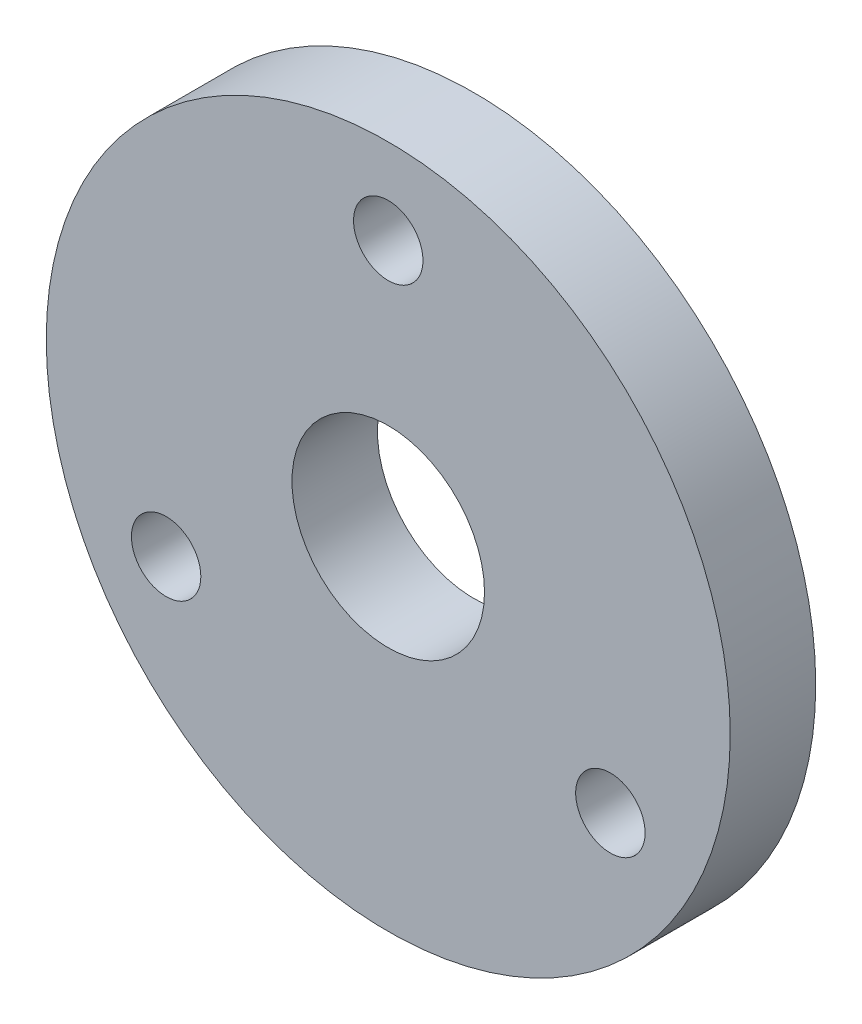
ISO-10303-21;
HEADER;
FILE_DESCRIPTION(('STEP AP214'),'2;1');
FILE_NAME('part.step','',(''),(''),'','','');
FILE_SCHEMA(('AUTOMOTIVE_DESIGN { 1 0 10303 214 1 1 1 1 }'));
ENDSEC;
DATA;
#1=APPLICATION_CONTEXT('core data for automotive mechanical design processes');
#2=APPLICATION_PROTOCOL_DEFINITION('international standard','automotive_design',2000,#1);
#3=PRODUCT_CONTEXT('',#1,'mechanical');
#4=PRODUCT('Part','Part','',(#3));
#5=PRODUCT_RELATED_PRODUCT_CATEGORY('part','',(#4));
#6=PRODUCT_DEFINITION_FORMATION('','',#4);
#7=PRODUCT_DEFINITION_CONTEXT('part definition',#1,'design');
#8=PRODUCT_DEFINITION('design','',#6,#7);
#9=PRODUCT_DEFINITION_SHAPE('','',#8);
#10=(LENGTH_UNIT() NAMED_UNIT(*) SI_UNIT(.MILLI.,.METRE.));
#11=(NAMED_UNIT(*) PLANE_ANGLE_UNIT() SI_UNIT($,.RADIAN.));
#12=(NAMED_UNIT(*) SI_UNIT($,.STERADIAN.) SOLID_ANGLE_UNIT());
#13=UNCERTAINTY_MEASURE_WITH_UNIT(LENGTH_MEASURE(1.E-05),#10,'distance_accuracy_value','');
#14=(GEOMETRIC_REPRESENTATION_CONTEXT(3) GLOBAL_UNCERTAINTY_ASSIGNED_CONTEXT((#13)) GLOBAL_UNIT_ASSIGNED_CONTEXT((#10,
#11,#12)) REPRESENTATION_CONTEXT('',''));
#15=CARTESIAN_POINT('',(0.,0.,0.));
#16=DIRECTION('',(0.,0.,1.));
#17=DIRECTION('',(1.,0.,0.));
#18=AXIS2_PLACEMENT_3D('',#15,#16,#17);
#19=CARTESIAN_POINT('',(0.,0.,3.175));
#20=DIRECTION('',(0.,0.,1.));
#21=DIRECTION('',(1.,0.,0.));
#22=AXIS2_PLACEMENT_3D('',#19,#20,#21);
#23=PLANE('',#22);
#24=CARTESIAN_POINT('',(-16.4977839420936,-9.52499999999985,3.175));
#25=DIRECTION('',(0.,0.,1.));
#26=DIRECTION('',(1.,0.,0.));
#27=AXIS2_PLACEMENT_3D('',#24,#25,#26);
#28=CIRCLE('',#27,2.57810000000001);
#29=CARTESIAN_POINT('',(-13.9196839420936,-9.52499999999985,3.175));
#30=VERTEX_POINT('',#29);
#31=EDGE_CURVE('E62',#30,#30,#28,.T.);
#32=ORIENTED_EDGE('',*,*,#31,.F.);
#33=EDGE_LOOP('',(#32));
#34=FACE_BOUND('',#33,.T.);
#35=CARTESIAN_POINT('',(16.4977839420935,-9.52500000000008,3.175));
#36=DIRECTION('',(0.,0.,1.));
#37=DIRECTION('',(1.,0.,0.));
#38=AXIS2_PLACEMENT_3D('',#35,#36,#37);
#39=CIRCLE('',#38,2.57810000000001);
#40=CARTESIAN_POINT('',(19.0758839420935,-9.52500000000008,3.175));
#41=VERTEX_POINT('',#40);
#42=EDGE_CURVE('E52',#41,#41,#39,.T.);
#43=ORIENTED_EDGE('',*,*,#42,.F.);
#44=EDGE_LOOP('',(#43));
#45=FACE_BOUND('',#44,.T.);
#46=CARTESIAN_POINT('',(0.,19.05,3.175));
#47=DIRECTION('',(0.,0.,1.));
#48=DIRECTION('',(1.,0.,0.));
#49=AXIS2_PLACEMENT_3D('',#46,#47,#48);
#50=CIRCLE('',#49,2.57810000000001);
#51=CARTESIAN_POINT('',(2.57810000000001,19.05,3.175));
#52=VERTEX_POINT('',#51);
#53=EDGE_CURVE('E49',#52,#52,#50,.T.);
#54=ORIENTED_EDGE('',*,*,#53,.F.);
#55=EDGE_LOOP('',(#54));
#56=FACE_BOUND('',#55,.T.);
#57=CARTESIAN_POINT('',(0.,0.,3.175));
#58=DIRECTION('',(0.,0.,1.));
#59=DIRECTION('',(1.,0.,0.));
#60=AXIS2_PLACEMENT_3D('',#57,#58,#59);
#61=CIRCLE('',#60,25.4);
#62=CARTESIAN_POINT('',(25.4,0.,3.175));
#63=VERTEX_POINT('',#62);
#64=EDGE_CURVE('E10',#63,#63,#61,.T.);
#65=ORIENTED_EDGE('',*,*,#64,.T.);
#66=EDGE_LOOP('',(#65));
#67=FACE_BOUND('',#66,.T.);
#68=CARTESIAN_POINT('',(0.,0.,3.175));
#69=DIRECTION('',(0.,0.,1.));
#70=DIRECTION('',(1.,0.,0.));
#71=AXIS2_PLACEMENT_3D('',#68,#69,#70);
#72=CIRCLE('',#71,7.1501);
#73=CARTESIAN_POINT('',(7.1501,0.,3.175));
#74=VERTEX_POINT('',#73);
#75=EDGE_CURVE('E42',#74,#74,#72,.T.);
#76=ORIENTED_EDGE('',*,*,#75,.F.);
#77=EDGE_LOOP('',(#76));
#78=FACE_BOUND('',#77,.T.);
#79=ADVANCED_FACE('F29',(#34,#45,#56,#67,#78),#23,.T.);
#80=CARTESIAN_POINT('',(0.,0.,-3.175));
#81=DIRECTION('',(0.,0.,1.));
#82=DIRECTION('',(1.,0.,0.));
#83=AXIS2_PLACEMENT_3D('',#80,#81,#82);
#84=PLANE('',#83);
#85=CARTESIAN_POINT('',(-16.4977839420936,-9.52499999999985,-3.175));
#86=DIRECTION('',(0.,0.,1.));
#87=DIRECTION('',(1.,0.,0.));
#88=AXIS2_PLACEMENT_3D('',#85,#86,#87);
#89=CIRCLE('',#88,2.57810000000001);
#90=CARTESIAN_POINT('',(-13.9196839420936,-9.52499999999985,-3.175));
#91=VERTEX_POINT('',#90);
#92=EDGE_CURVE('E33',#91,#91,#89,.T.);
#93=ORIENTED_EDGE('',*,*,#92,.T.);
#94=EDGE_LOOP('',(#93));
#95=FACE_BOUND('',#94,.T.);
#96=CARTESIAN_POINT('',(16.4977839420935,-9.52500000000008,-3.175));
#97=DIRECTION('',(0.,0.,1.));
#98=DIRECTION('',(1.,0.,0.));
#99=AXIS2_PLACEMENT_3D('',#96,#97,#98);
#100=CIRCLE('',#99,2.57810000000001);
#101=CARTESIAN_POINT('',(19.0758839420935,-9.52500000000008,-3.175));
#102=VERTEX_POINT('',#101);
#103=EDGE_CURVE('E50',#102,#102,#100,.T.);
#104=ORIENTED_EDGE('',*,*,#103,.T.);
#105=EDGE_LOOP('',(#104));
#106=FACE_BOUND('',#105,.T.);
#107=CARTESIAN_POINT('',(0.,19.05,-3.175));
#108=DIRECTION('',(0.,0.,1.));
#109=DIRECTION('',(1.,0.,0.));
#110=AXIS2_PLACEMENT_3D('',#107,#108,#109);
#111=CIRCLE('',#110,2.57810000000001);
#112=CARTESIAN_POINT('',(2.57810000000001,19.05,-3.175));
#113=VERTEX_POINT('',#112);
#114=EDGE_CURVE('E46',#113,#113,#111,.T.);
#115=ORIENTED_EDGE('',*,*,#114,.T.);
#116=EDGE_LOOP('',(#115));
#117=FACE_BOUND('',#116,.T.);
#118=CARTESIAN_POINT('',(0.,0.,-3.175));
#119=DIRECTION('',(0.,0.,1.));
#120=DIRECTION('',(1.,0.,0.));
#121=AXIS2_PLACEMENT_3D('',#118,#119,#120);
#122=CIRCLE('',#121,25.4);
#123=CARTESIAN_POINT('',(25.4,0.,-3.175));
#124=VERTEX_POINT('',#123);
#125=EDGE_CURVE('E37',#124,#124,#122,.T.);
#126=ORIENTED_EDGE('',*,*,#125,.F.);
#127=EDGE_LOOP('',(#126));
#128=FACE_BOUND('',#127,.T.);
#129=CARTESIAN_POINT('',(0.,0.,-3.175));
#130=DIRECTION('',(0.,0.,1.));
#131=DIRECTION('',(1.,0.,0.));
#132=AXIS2_PLACEMENT_3D('',#129,#130,#131);
#133=CIRCLE('',#132,7.1501);
#134=CARTESIAN_POINT('',(7.1501,0.,-3.175));
#135=VERTEX_POINT('',#134);
#136=EDGE_CURVE('E48',#135,#135,#133,.T.);
#137=ORIENTED_EDGE('',*,*,#136,.T.);
#138=EDGE_LOOP('',(#137));
#139=FACE_BOUND('',#138,.T.);
#140=ADVANCED_FACE('F73',(#95,#106,#117,#128,#139),#84,.F.);
#141=CARTESIAN_POINT('',(0.,0.,3.175));
#142=DIRECTION('',(0.,0.,-1.));
#143=DIRECTION('',(-1.,0.,0.));
#144=AXIS2_PLACEMENT_3D('',#141,#142,#143);
#145=CYLINDRICAL_SURFACE('',#144,25.4);
#146=ORIENTED_EDGE('',*,*,#64,.F.);
#147=EDGE_LOOP('',(#146));
#148=FACE_BOUND('',#147,.T.);
#149=ORIENTED_EDGE('',*,*,#125,.T.);
#150=EDGE_LOOP('',(#149));
#151=FACE_BOUND('',#150,.T.);
#152=ADVANCED_FACE('F31',(#148,#151),#145,.T.);
#153=CARTESIAN_POINT('',(0.,0.,3.175));
#154=DIRECTION('',(0.,0.,-1.));
#155=DIRECTION('',(-1.,0.,0.));
#156=AXIS2_PLACEMENT_3D('',#153,#154,#155);
#157=CYLINDRICAL_SURFACE('',#156,7.1501);
#158=ORIENTED_EDGE('',*,*,#75,.T.);
#159=EDGE_LOOP('',(#158));
#160=FACE_BOUND('',#159,.T.);
#161=ORIENTED_EDGE('',*,*,#136,.F.);
#162=EDGE_LOOP('',(#161));
#163=FACE_BOUND('',#162,.T.);
#164=ADVANCED_FACE('F69',(#160,#163),#157,.F.);
#165=CARTESIAN_POINT('',(0.,19.05,3.175));
#166=DIRECTION('',(0.,0.,1.));
#167=DIRECTION('',(1.,0.,0.));
#168=AXIS2_PLACEMENT_3D('',#165,#166,#167);
#169=CYLINDRICAL_SURFACE('',#168,2.57810000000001);
#170=ORIENTED_EDGE('',*,*,#53,.T.);
#171=EDGE_LOOP('',(#170));
#172=FACE_BOUND('',#171,.T.);
#173=ORIENTED_EDGE('',*,*,#114,.F.);
#174=EDGE_LOOP('',(#173));
#175=FACE_BOUND('',#174,.T.);
#176=ADVANCED_FACE('F85',(#172,#175),#169,.F.);
#177=CARTESIAN_POINT('',(16.4977839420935,-9.52500000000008,3.175));
#178=DIRECTION('',(0.,0.,1.));
#179=DIRECTION('',(1.,0.,0.));
#180=AXIS2_PLACEMENT_3D('',#177,#178,#179);
#181=CYLINDRICAL_SURFACE('',#180,2.57810000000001);
#182=ORIENTED_EDGE('',*,*,#42,.T.);
#183=EDGE_LOOP('',(#182));
#184=FACE_BOUND('',#183,.T.);
#185=ORIENTED_EDGE('',*,*,#103,.F.);
#186=EDGE_LOOP('',(#185));
#187=FACE_BOUND('',#186,.T.);
#188=ADVANCED_FACE('F88',(#184,#187),#181,.F.);
#189=CARTESIAN_POINT('',(-16.4977839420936,-9.52499999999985,3.175));
#190=DIRECTION('',(0.,0.,1.));
#191=DIRECTION('',(1.,0.,0.));
#192=AXIS2_PLACEMENT_3D('',#189,#190,#191);
#193=CYLINDRICAL_SURFACE('',#192,2.57810000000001);
#194=ORIENTED_EDGE('',*,*,#31,.T.);
#195=EDGE_LOOP('',(#194));
#196=FACE_BOUND('',#195,.T.);
#197=ORIENTED_EDGE('',*,*,#92,.F.);
#198=EDGE_LOOP('',(#197));
#199=FACE_BOUND('',#198,.T.);
#200=ADVANCED_FACE('F92',(#196,#199),#193,.F.);
#201=CLOSED_SHELL('',(#79,#140,#152,#164,#176,#188,#200));
#202=MANIFOLD_SOLID_BREP('B2',#201);
#203=ADVANCED_BREP_SHAPE_REPRESENTATION('',(#18,#202),#14);
#204=SHAPE_DEFINITION_REPRESENTATION(#9,#203);
ENDSEC;
END-ISO-10303-21;
